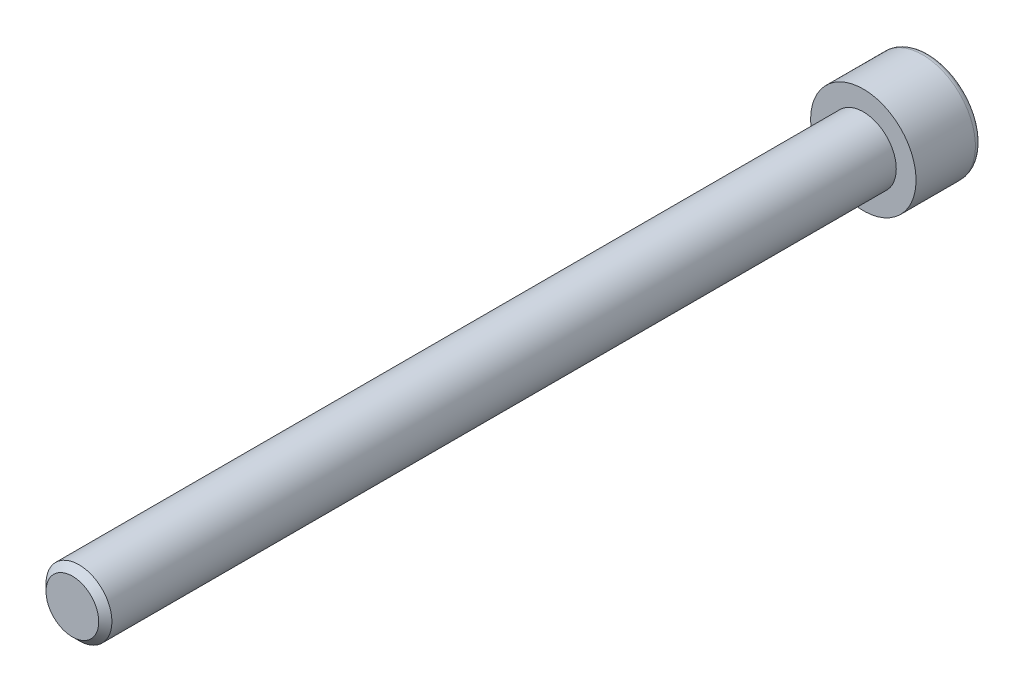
ISO-10303-21;
HEADER;
FILE_DESCRIPTION(('STEP AP214'),'2;1');
FILE_NAME('part.step','',(''),(''),'','','');
FILE_SCHEMA(('AUTOMOTIVE_DESIGN { 1 0 10303 214 1 1 1 1 }'));
ENDSEC;
DATA;
#1=APPLICATION_CONTEXT('core data for automotive mechanical design processes');
#2=APPLICATION_PROTOCOL_DEFINITION('international standard','automotive_design',2000,#1);
#3=PRODUCT_CONTEXT('',#1,'mechanical');
#4=PRODUCT('Part','Part','',(#3));
#5=PRODUCT_RELATED_PRODUCT_CATEGORY('part','',(#4));
#6=PRODUCT_DEFINITION_FORMATION('','',#4);
#7=PRODUCT_DEFINITION_CONTEXT('part definition',#1,'design');
#8=PRODUCT_DEFINITION('design','',#6,#7);
#9=PRODUCT_DEFINITION_SHAPE('','',#8);
#10=(LENGTH_UNIT() NAMED_UNIT(*) SI_UNIT(.MILLI.,.METRE.));
#11=(NAMED_UNIT(*) PLANE_ANGLE_UNIT() SI_UNIT($,.RADIAN.));
#12=(NAMED_UNIT(*) SI_UNIT($,.STERADIAN.) SOLID_ANGLE_UNIT());
#13=UNCERTAINTY_MEASURE_WITH_UNIT(LENGTH_MEASURE(1.E-05),#10,'distance_accuracy_value','');
#14=(GEOMETRIC_REPRESENTATION_CONTEXT(3) GLOBAL_UNCERTAINTY_ASSIGNED_CONTEXT((#13)) GLOBAL_UNIT_ASSIGNED_CONTEXT((#10,
#11,#12)) REPRESENTATION_CONTEXT('',''));
#15=CARTESIAN_POINT('',(0.,0.,0.));
#16=DIRECTION('',(0.,0.,1.));
#17=DIRECTION('',(1.,0.,0.));
#18=AXIS2_PLACEMENT_3D('',#15,#16,#17);
#19=CARTESIAN_POINT('',(0.,0.,0.));
#20=DIRECTION('',(0.,0.,1.));
#21=DIRECTION('',(1.,0.,0.));
#22=AXIS2_PLACEMENT_3D('',#19,#20,#21);
#23=CYLINDRICAL_SURFACE('',#22,5.);
#24=CARTESIAN_POINT('',(0.,0.,0.));
#25=DIRECTION('',(0.,0.,1.));
#26=DIRECTION('',(1.,0.,0.));
#27=AXIS2_PLACEMENT_3D('',#24,#25,#26);
#28=CIRCLE('',#27,5.);
#29=CARTESIAN_POINT('',(5.,0.,0.));
#30=VERTEX_POINT('',#29);
#31=EDGE_CURVE('E226',#30,#30,#28,.T.);
#32=ORIENTED_EDGE('',*,*,#31,.T.);
#33=EDGE_LOOP('',(#32));
#34=FACE_BOUND('',#33,.T.);
#35=CARTESIAN_POINT('',(0.,0.,119.));
#36=DIRECTION('',(0.,0.,1.));
#37=DIRECTION('',(1.,0.,0.));
#38=AXIS2_PLACEMENT_3D('',#35,#36,#37);
#39=CIRCLE('',#38,5.);
#40=CARTESIAN_POINT('',(5.00000000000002,0.,119.));
#41=VERTEX_POINT('',#40);
#42=EDGE_CURVE('E12',#41,#41,#39,.F.);
#43=ORIENTED_EDGE('',*,*,#42,.T.);
#44=EDGE_LOOP('',(#43));
#45=FACE_BOUND('',#44,.T.);
#46=CARTESIAN_POINT('',(-4.83290553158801,-1.28180509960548,71.1037529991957));
#47=CARTESIAN_POINT('',(-4.85551320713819,-1.19654589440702,71.0233285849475));
#48=CARTESIAN_POINT('',(-4.87719702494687,-1.10575607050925,70.9484886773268));
#49=CARTESIAN_POINT('',(-4.91694141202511,-0.912870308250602,70.8139120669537));
#50=CARTESIAN_POINT('',(-4.93500975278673,-0.810799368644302,70.7541428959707));
#51=CARTESIAN_POINT('',(-4.96184102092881,-0.622034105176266,70.6664230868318));
#52=CARTESIAN_POINT('',(-4.97179530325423,-0.537467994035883,70.6342845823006));
#53=CARTESIAN_POINT('',(-4.98749781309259,-0.363909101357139,70.5838433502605));
#54=CARTESIAN_POINT('',(-4.99324959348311,-0.274920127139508,70.5655289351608));
#55=CARTESIAN_POINT('',(-4.99992507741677,-0.0944849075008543,70.5442897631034));
#56=CARTESIAN_POINT('',(-5.00082625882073,-0.00302917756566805,70.5414367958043));
#57=CARTESIAN_POINT('',(-4.99762698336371,0.178906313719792,70.5516007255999));
#58=CARTESIAN_POINT('',(-4.99352557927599,0.269385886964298,70.5646206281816));
#59=CARTESIAN_POINT('',(-4.98121720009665,0.440920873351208,70.6039898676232));
#60=CARTESIAN_POINT('',(-4.97328866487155,0.522209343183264,70.6294364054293));
#61=CARTESIAN_POINT('',(-4.95418277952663,0.680001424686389,70.6913868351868));
#62=CARTESIAN_POINT('',(-4.94300409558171,0.756503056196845,70.7278952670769));
#63=CARTESIAN_POINT('',(-4.91171162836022,0.942348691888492,70.8314826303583));
#64=CARTESIAN_POINT('',(-4.88997563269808,1.04806174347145,70.9045827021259));
#65=CARTESIAN_POINT('',(-4.84329103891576,1.24617454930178,71.0662247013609));
#66=CARTESIAN_POINT('',(-4.81833353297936,1.33853582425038,71.1548096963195));
#67=CARTESIAN_POINT('',(-4.75491063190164,1.55194758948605,71.3886160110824));
#68=CARTESIAN_POINT('',(-4.71572895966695,1.66538972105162,71.540565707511));
#69=CARTESIAN_POINT('',(-4.63963148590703,1.86692267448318,71.8607758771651));
#70=CARTESIAN_POINT('',(-4.60271868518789,1.95498046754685,72.0290572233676));
#71=CARTESIAN_POINT('',(-4.53364209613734,2.11035114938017,72.3840218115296));
#72=CARTESIAN_POINT('',(-4.50172293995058,2.17670919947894,72.5711690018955));
#73=CARTESIAN_POINT('',(-4.44817466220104,2.28415762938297,72.953903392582));
#74=CARTESIAN_POINT('',(-4.42653815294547,2.32526615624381,73.1494844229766));
#75=CARTESIAN_POINT('',(-4.40249291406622,2.37031074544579,73.4638618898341));
#76=CARTESIAN_POINT('',(-4.39583697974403,2.38257930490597,73.5812109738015));
#77=CARTESIAN_POINT('',(-4.38734021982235,2.39819451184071,73.8167097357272));
#78=CARTESIAN_POINT('',(-4.38549988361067,2.40154025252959,73.9348594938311));
#79=CARTESIAN_POINT('',(-4.38673716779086,2.39927812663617,74.1711218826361));
#80=CARTESIAN_POINT('',(-4.38981812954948,2.3936641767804,74.2892344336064));
#81=CARTESIAN_POINT('',(-4.40074724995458,2.37351112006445,74.5244675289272));
#82=CARTESIAN_POINT('',(-4.40859521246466,2.35897238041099,74.6415881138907));
#83=CARTESIAN_POINT('',(-4.42848389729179,2.32141575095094,74.871745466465));
#84=CARTESIAN_POINT('',(-4.44044031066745,2.29856786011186,74.9848173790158));
#85=CARTESIAN_POINT('',(-4.46805516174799,2.24441666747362,75.2085107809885));
#86=CARTESIAN_POINT('',(-4.48371532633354,2.21310942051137,75.3191311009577));
#87=CARTESIAN_POINT('',(-4.51809540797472,2.14204884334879,75.5371264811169));
#88=CARTESIAN_POINT('',(-4.53681491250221,2.102296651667,75.6445019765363));
#89=CARTESIAN_POINT('',(-4.57659337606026,2.01422971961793,75.855235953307));
#90=CARTESIAN_POINT('',(-4.59765256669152,1.96591413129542,75.9585940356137));
#91=CARTESIAN_POINT('',(-4.65207529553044,1.83452683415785,76.2100404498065));
#92=CARTESIAN_POINT('',(-4.68640014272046,1.74604262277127,76.3551522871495));
#93=CARTESIAN_POINT('',(-4.75549317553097,1.54798994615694,76.6300024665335));
#94=CARTESIAN_POINT('',(-4.79026024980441,1.43846720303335,76.7597731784));
#95=CARTESIAN_POINT('',(-4.84563418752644,1.23571015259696,76.9583665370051));
#96=CARTESIAN_POINT('',(-4.86717271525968,1.14873828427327,77.0332954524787));
#97=CARTESIAN_POINT('',(-4.90710454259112,0.963962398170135,77.1694696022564));
#98=CARTESIAN_POINT('',(-4.92550247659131,0.866174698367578,77.230735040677));
#99=CARTESIAN_POINT('',(-4.95404619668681,0.68139344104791,77.324571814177));
#100=CARTESIAN_POINT('',(-4.96510884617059,0.596232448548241,77.3604425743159));
#101=CARTESIAN_POINT('',(-4.98303340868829,0.420854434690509,77.4182087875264));
#102=CARTESIAN_POINT('',(-4.98989929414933,0.330642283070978,77.4401174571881));
#103=CARTESIAN_POINT('',(-4.99868891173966,0.146961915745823,77.468119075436));
#104=CARTESIAN_POINT('',(-5.0005836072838,0.0534777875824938,77.4741191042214));
#105=CARTESIAN_POINT('',(-4.99909999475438,-0.133025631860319,77.4694074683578));
#106=CARTESIAN_POINT('',(-4.99572143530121,-0.226044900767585,77.4586950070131));
#107=CARTESIAN_POINT('',(-4.98462851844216,-0.400591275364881,77.4232682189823));
#108=CARTESIAN_POINT('',(-4.97731555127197,-0.482415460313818,77.3998486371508));
#109=CARTESIAN_POINT('',(-4.95932540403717,-0.641491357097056,77.3416753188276));
#110=CARTESIAN_POINT('',(-4.94864687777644,-0.718741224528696,77.3069170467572));
#111=CARTESIAN_POINT('',(-4.91888005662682,-0.903990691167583,77.2087654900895));
#112=CARTESIAN_POINT('',(-4.89822588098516,-1.00871016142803,77.1396628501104));
#113=CARTESIAN_POINT('',(-4.85356882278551,-1.20544889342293,76.9861161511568));
#114=CARTESIAN_POINT('',(-4.82955697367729,-1.29743279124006,76.9016308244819));
#115=CARTESIAN_POINT('',(-4.76821561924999,-1.51052808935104,76.678009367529));
#116=CARTESIAN_POINT('',(-4.73004372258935,-1.62431984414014,76.5321545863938));
#117=CARTESIAN_POINT('',(-4.65532123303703,-1.8274803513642,76.2241274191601));
#118=CARTESIAN_POINT('',(-4.61877291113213,-1.91681574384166,76.0619331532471));
#119=CARTESIAN_POINT('',(-4.54952646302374,-2.07596493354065,75.7189820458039));
#120=CARTESIAN_POINT('',(-4.51705175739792,-2.14481201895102,75.5377336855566));
#121=CARTESIAN_POINT('',(-4.46136958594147,-2.25836298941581,75.16653618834));
#122=CARTESIAN_POINT('',(-4.43815699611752,-2.30308022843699,74.9765919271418));
#123=CARTESIAN_POINT('',(-4.41059839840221,-2.35522321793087,74.6683179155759));
#124=CARTESIAN_POINT('',(-4.40242042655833,-2.37040772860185,74.5515799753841));
#125=CARTESIAN_POINT('',(-4.39078261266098,-2.39190056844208,74.3170211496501));
#126=CARTESIAN_POINT('',(-4.38732327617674,-2.39820794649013,74.1992001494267));
#127=CARTESIAN_POINT('',(-4.38530415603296,-2.40189704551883,73.9633493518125));
#128=CARTESIAN_POINT('',(-4.38674569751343,-2.39927635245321,73.845319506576));
#129=CARTESIAN_POINT('',(-4.39445671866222,-2.38512372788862,73.6099591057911));
#130=CARTESIAN_POINT('',(-4.40072599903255,-2.37359216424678,73.4926285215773));
#131=CARTESIAN_POINT('',(-4.41763143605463,-2.34197485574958,73.2616188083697));
#132=CARTESIAN_POINT('',(-4.42818669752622,-2.32204733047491,73.147912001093));
#133=CARTESIAN_POINT('',(-4.45318920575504,-2.27372921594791,72.9226979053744));
#134=CARTESIAN_POINT('',(-4.46763815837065,-2.2453349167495,72.8111916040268));
#135=CARTESIAN_POINT('',(-4.49984159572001,-2.18008109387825,72.5910398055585));
#136=CARTESIAN_POINT('',(-4.51759943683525,-2.14321296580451,72.4823973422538));
#137=CARTESIAN_POINT('',(-4.55571262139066,-2.06095262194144,72.2688529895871));
#138=CARTESIAN_POINT('',(-4.57606851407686,-2.01555860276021,72.1639518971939));
#139=CARTESIAN_POINT('',(-4.63426338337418,-1.87949450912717,71.8832973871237));
#140=CARTESIAN_POINT('',(-4.67396659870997,-1.78005066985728,71.7120644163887));
#141=CARTESIAN_POINT('',(-4.75428755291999,-1.55281951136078,71.3899217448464));
#142=CARTESIAN_POINT('',(-4.79490185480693,-1.42512648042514,71.2389470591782));
#143=CARTESIAN_POINT('',(-4.83290553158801,-1.28180509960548,71.1037529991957));
#144=B_SPLINE_CURVE_WITH_KNOTS('',3,(#46,#47,#48,#49,#50,#51,#52,#53,#54,#55,#56,#57,#58,#59,
#60,#61,#62,#63,#64,#65,#66,#67,#68,#69,#70,#71,#72,#73,#74,#75,#76,#77,#78,#79,#80,#81,#82,#83,
#84,#85,#86,#87,#88,#89,#90,#91,#92,#93,#94,#95,#96,#97,#98,#99,#100,#101,#102,#103,#104,#105,
#106,#107,#108,#109,#110,#111,#112,#113,#114,#115,#116,#117,#118,#119,#120,#121,#122,#123,#124,
#125,#126,#127,#128,#129,#130,#131,#132,#133,#134,#135,#136,#137,#138,#139,#140,#141,#142,#143),
.UNSPECIFIED.,.T.,.F.,(4,2,2,2,2,2,2,2,2,2,2,2,2,2,2,2,2,2,2,2,2,2,2,2,2,2,2,2,2,2,2,2,2,2,2,2,
2,2,2,2,2,2,2,2,2,2,2,2,4),(0.,0.357758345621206,0.71473922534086,0.986692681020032,
1.25841595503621,1.53139980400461,1.80443534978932,2.06006244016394,2.3157945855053,
2.70463294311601,3.09457048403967,3.67232098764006,4.25081987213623,4.85212816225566,
5.45300377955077,5.8071481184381,6.16132844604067,6.51574935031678,6.87015567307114,
7.21768527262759,7.56537722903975,7.91302234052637,8.26070189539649,8.77922294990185,
9.29662962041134,9.64599376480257,9.99483782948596,10.272938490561,10.5507755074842,
10.8302317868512,11.1097013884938,11.3649364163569,11.6202736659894,11.9995802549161,
12.379919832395,12.9435130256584,13.5078712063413,14.0957069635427,14.6832170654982,
15.0368505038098,15.3905218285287,15.7442887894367,16.0980411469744,16.4454059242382,
16.7929231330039,17.1407947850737,17.4887401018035,18.0921189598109,18.6935134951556),.UNSPECIFIED.);
#145=CARTESIAN_POINT('',(-4.83290553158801,-1.28180509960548,71.1037529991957));
#146=VERTEX_POINT('',#145);
#147=EDGE_CURVE('E48',#146,#146,#144,.T.);
#148=ORIENTED_EDGE('',*,*,#147,.T.);
#149=EDGE_LOOP('',(#148));
#150=FACE_BOUND('',#149,.T.);
#151=ADVANCED_FACE('F44',(#34,#45,#150),#23,.T.);
#152=CARTESIAN_POINT('',(0.,0.,-10.));
#153=DIRECTION('',(0.,0.,1.));
#154=DIRECTION('',(1.,0.,0.));
#155=AXIS2_PLACEMENT_3D('',#152,#153,#154);
#156=PLANE('',#155);
#157=CARTESIAN_POINT('',(0.,0.,-10.));
#158=DIRECTION('',(0.,0.,-1.));
#159=DIRECTION('',(-1.,0.,0.));
#160=AXIS2_PLACEMENT_3D('',#157,#158,#159);
#161=CIRCLE('',#160,7.);
#162=CARTESIAN_POINT('',(-7.,0.,-10.));
#163=VERTEX_POINT('',#162);
#164=EDGE_CURVE('E172',#163,#163,#161,.T.);
#165=ORIENTED_EDGE('',*,*,#164,.T.);
#166=EDGE_LOOP('',(#165));
#167=FACE_BOUND('',#166,.T.);
#168=DIRECTION('',(-0.86602540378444,0.499999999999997,0.));
#169=VECTOR('',#168,1.);
#170=CARTESIAN_POINT('',(0.,4.61880215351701,-10.));
#171=LINE('',#170,#169);
#172=CARTESIAN_POINT('',(4.,2.30940107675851,-10.));
#173=VERTEX_POINT('',#172);
#174=CARTESIAN_POINT('',(0.,4.61880215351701,-10.));
#175=VERTEX_POINT('',#174);
#176=EDGE_CURVE('E65',#173,#175,#171,.T.);
#177=ORIENTED_EDGE('',*,*,#176,.T.);
#178=DIRECTION('',(-0.866025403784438,-0.500000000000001,0.));
#179=VECTOR('',#178,1.);
#180=CARTESIAN_POINT('',(0.,4.61880215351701,-10.));
#181=LINE('',#180,#179);
#182=CARTESIAN_POINT('',(-4.,2.30940107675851,-10.));
#183=VERTEX_POINT('',#182);
#184=EDGE_CURVE('E222',#175,#183,#181,.T.);
#185=ORIENTED_EDGE('',*,*,#184,.T.);
#186=DIRECTION('',(0.,-1.,0.));
#187=VECTOR('',#186,1.);
#188=CARTESIAN_POINT('',(-4.,-2.30940107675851,-10.));
#189=LINE('',#188,#187);
#190=CARTESIAN_POINT('',(-4.,-2.30940107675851,-10.));
#191=VERTEX_POINT('',#190);
#192=EDGE_CURVE('E219',#183,#191,#189,.T.);
#193=ORIENTED_EDGE('',*,*,#192,.T.);
#194=DIRECTION('',(0.866025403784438,-0.500000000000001,0.));
#195=VECTOR('',#194,1.);
#196=CARTESIAN_POINT('',(0.,-4.61880215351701,-10.));
#197=LINE('',#196,#195);
#198=CARTESIAN_POINT('',(0.,-4.61880215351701,-10.));
#199=VERTEX_POINT('',#198);
#200=EDGE_CURVE('E216',#191,#199,#197,.T.);
#201=ORIENTED_EDGE('',*,*,#200,.T.);
#202=DIRECTION('',(0.86602540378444,0.499999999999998,0.));
#203=VECTOR('',#202,1.);
#204=CARTESIAN_POINT('',(0.,-4.61880215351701,-10.));
#205=LINE('',#204,#203);
#206=CARTESIAN_POINT('',(4.,-2.30940107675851,-10.));
#207=VERTEX_POINT('',#206);
#208=EDGE_CURVE('E213',#199,#207,#205,.T.);
#209=ORIENTED_EDGE('',*,*,#208,.T.);
#210=DIRECTION('',(0.,1.,0.));
#211=VECTOR('',#210,1.);
#212=CARTESIAN_POINT('',(4.,-2.30940107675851,-10.));
#213=LINE('',#212,#211);
#214=EDGE_CURVE('E210',#207,#173,#213,.T.);
#215=ORIENTED_EDGE('',*,*,#214,.T.);
#216=EDGE_LOOP('',(#177,#185,#193,#201,#209,#215));
#217=FACE_BOUND('',#216,.T.);
#218=ADVANCED_FACE('F46',(#167,#217),#156,.F.);
#219=CARTESIAN_POINT('',(0.,0.,-9.));
#220=DIRECTION('',(0.,0.,-1.));
#221=DIRECTION('',(-1.,0.,0.));
#222=AXIS2_PLACEMENT_3D('',#219,#220,#221);
#223=TOROIDAL_SURFACE('',#222,7.,0.999999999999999);
#224=ORIENTED_EDGE('',*,*,#164,.F.);
#225=EDGE_LOOP('',(#224));
#226=FACE_BOUND('',#225,.T.);
#227=CARTESIAN_POINT('',(0.,0.,-9.));
#228=DIRECTION('',(0.,0.,-1.));
#229=DIRECTION('',(-1.,0.,0.));
#230=AXIS2_PLACEMENT_3D('',#227,#228,#229);
#231=CIRCLE('',#230,8.);
#232=CARTESIAN_POINT('',(-8.,0.,-9.));
#233=VERTEX_POINT('',#232);
#234=EDGE_CURVE('E175',#233,#233,#231,.T.);
#235=ORIENTED_EDGE('',*,*,#234,.T.);
#236=EDGE_LOOP('',(#235));
#237=FACE_BOUND('',#236,.T.);
#238=ADVANCED_FACE('F123',(#226,#237),#223,.T.);
#239=CARTESIAN_POINT('',(0.,0.,0.));
#240=DIRECTION('',(0.,0.,-1.));
#241=DIRECTION('',(-1.,0.,0.));
#242=AXIS2_PLACEMENT_3D('',#239,#240,#241);
#243=CYLINDRICAL_SURFACE('',#242,8.);
#244=ORIENTED_EDGE('',*,*,#234,.F.);
#245=EDGE_LOOP('',(#244));
#246=FACE_BOUND('',#245,.T.);
#247=CARTESIAN_POINT('',(0.,0.,0.));
#248=DIRECTION('',(0.,0.,-1.));
#249=DIRECTION('',(-1.,0.,0.));
#250=AXIS2_PLACEMENT_3D('',#247,#248,#249);
#251=CIRCLE('',#250,8.);
#252=CARTESIAN_POINT('',(-8.,0.,0.));
#253=VERTEX_POINT('',#252);
#254=EDGE_CURVE('E176',#253,#253,#251,.T.);
#255=ORIENTED_EDGE('',*,*,#254,.T.);
#256=EDGE_LOOP('',(#255));
#257=FACE_BOUND('',#256,.T.);
#258=ADVANCED_FACE('F161',(#246,#257),#243,.T.);
#259=CARTESIAN_POINT('',(0.,0.,0.));
#260=DIRECTION('',(0.,0.,-1.));
#261=DIRECTION('',(-1.,0.,0.));
#262=AXIS2_PLACEMENT_3D('',#259,#260,#261);
#263=PLANE('',#262);
#264=ORIENTED_EDGE('',*,*,#31,.F.);
#265=EDGE_LOOP('',(#264));
#266=FACE_BOUND('',#265,.T.);
#267=ORIENTED_EDGE('',*,*,#254,.F.);
#268=EDGE_LOOP('',(#267));
#269=FACE_BOUND('',#268,.T.);
#270=ADVANCED_FACE('F158',(#266,#269),#263,.F.);
#271=CARTESIAN_POINT('',(0.,4.61880215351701,-5.));
#272=DIRECTION('',(-0.499999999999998,-0.86602540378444,0.));
#273=DIRECTION('',(0.86602540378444,-0.499999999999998,0.));
#274=AXIS2_PLACEMENT_3D('',#271,#272,#273);
#275=PLANE('',#274);
#276=ORIENTED_EDGE('',*,*,#176,.F.);
#277=DIRECTION('',(0.,0.,-1.));
#278=VECTOR('',#277,1.);
#279=CARTESIAN_POINT('',(4.,2.30940107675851,-5.));
#280=LINE('',#279,#278);
#281=CARTESIAN_POINT('',(4.,2.30940107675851,-5.));
#282=VERTEX_POINT('',#281);
#283=EDGE_CURVE('E196',#282,#173,#280,.T.);
#284=ORIENTED_EDGE('',*,*,#283,.F.);
#285=DIRECTION('',(-0.86602540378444,0.499999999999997,0.));
#286=VECTOR('',#285,1.);
#287=CARTESIAN_POINT('',(0.,4.61880215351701,-5.));
#288=LINE('',#287,#286);
#289=CARTESIAN_POINT('',(0.,4.61880215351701,-5.));
#290=VERTEX_POINT('',#289);
#291=EDGE_CURVE('E207',#282,#290,#288,.T.);
#292=ORIENTED_EDGE('',*,*,#291,.T.);
#293=DIRECTION('',(0.,0.,-1.));
#294=VECTOR('',#293,1.);
#295=CARTESIAN_POINT('',(0.,4.61880215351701,-5.));
#296=LINE('',#295,#294);
#297=EDGE_CURVE('E179',#290,#175,#296,.T.);
#298=ORIENTED_EDGE('',*,*,#297,.T.);
#299=EDGE_LOOP('',(#276,#284,#292,#298));
#300=FACE_BOUND('',#299,.T.);
#301=ADVANCED_FACE('F154',(#300),#275,.T.);
#302=CARTESIAN_POINT('',(0.,4.61880215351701,-5.));
#303=DIRECTION('',(0.500000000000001,-0.866025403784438,0.));
#304=DIRECTION('',(0.866025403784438,0.500000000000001,0.));
#305=AXIS2_PLACEMENT_3D('',#302,#303,#304);
#306=PLANE('',#305);
#307=ORIENTED_EDGE('',*,*,#184,.F.);
#308=ORIENTED_EDGE('',*,*,#297,.F.);
#309=DIRECTION('',(-0.866025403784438,-0.500000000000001,0.));
#310=VECTOR('',#309,1.);
#311=CARTESIAN_POINT('',(0.,4.61880215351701,-5.));
#312=LINE('',#311,#310);
#313=CARTESIAN_POINT('',(-4.,2.30940107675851,-5.));
#314=VERTEX_POINT('',#313);
#315=EDGE_CURVE('E205',#290,#314,#312,.T.);
#316=ORIENTED_EDGE('',*,*,#315,.T.);
#317=DIRECTION('',(0.,0.,-1.));
#318=VECTOR('',#317,1.);
#319=CARTESIAN_POINT('',(-4.,2.30940107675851,-5.));
#320=LINE('',#319,#318);
#321=EDGE_CURVE('E188',#314,#183,#320,.T.);
#322=ORIENTED_EDGE('',*,*,#321,.T.);
#323=EDGE_LOOP('',(#307,#308,#316,#322));
#324=FACE_BOUND('',#323,.T.);
#325=ADVANCED_FACE('F150',(#324),#306,.T.);
#326=CARTESIAN_POINT('',(-4.,-2.30940107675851,-5.));
#327=DIRECTION('',(1.,0.,0.));
#328=DIRECTION('',(0.,0.,-1.));
#329=AXIS2_PLACEMENT_3D('',#326,#327,#328);
#330=PLANE('',#329);
#331=ORIENTED_EDGE('',*,*,#192,.F.);
#332=ORIENTED_EDGE('',*,*,#321,.F.);
#333=DIRECTION('',(0.,-1.,0.));
#334=VECTOR('',#333,1.);
#335=CARTESIAN_POINT('',(-4.,-2.30940107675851,-5.));
#336=LINE('',#335,#334);
#337=CARTESIAN_POINT('',(-4.,-2.30940107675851,-5.));
#338=VERTEX_POINT('',#337);
#339=EDGE_CURVE('E203',#314,#338,#336,.T.);
#340=ORIENTED_EDGE('',*,*,#339,.T.);
#341=DIRECTION('',(0.,0.,-1.));
#342=VECTOR('',#341,1.);
#343=CARTESIAN_POINT('',(-4.,-2.30940107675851,-5.));
#344=LINE('',#343,#342);
#345=EDGE_CURVE('E190',#338,#191,#344,.T.);
#346=ORIENTED_EDGE('',*,*,#345,.T.);
#347=EDGE_LOOP('',(#331,#332,#340,#346));
#348=FACE_BOUND('',#347,.T.);
#349=ADVANCED_FACE('F146',(#348),#330,.T.);
#350=CARTESIAN_POINT('',(0.,-4.61880215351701,-5.));
#351=DIRECTION('',(0.500000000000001,0.866025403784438,0.));
#352=DIRECTION('',(-0.866025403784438,0.500000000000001,0.));
#353=AXIS2_PLACEMENT_3D('',#350,#351,#352);
#354=PLANE('',#353);
#355=ORIENTED_EDGE('',*,*,#200,.F.);
#356=ORIENTED_EDGE('',*,*,#345,.F.);
#357=DIRECTION('',(0.866025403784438,-0.500000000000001,0.));
#358=VECTOR('',#357,1.);
#359=CARTESIAN_POINT('',(0.,-4.61880215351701,-5.));
#360=LINE('',#359,#358);
#361=CARTESIAN_POINT('',(0.,-4.61880215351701,-5.));
#362=VERTEX_POINT('',#361);
#363=EDGE_CURVE('E201',#338,#362,#360,.T.);
#364=ORIENTED_EDGE('',*,*,#363,.T.);
#365=DIRECTION('',(0.,0.,-1.));
#366=VECTOR('',#365,1.);
#367=CARTESIAN_POINT('',(0.,-4.61880215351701,-5.));
#368=LINE('',#367,#366);
#369=EDGE_CURVE('E192',#362,#199,#368,.T.);
#370=ORIENTED_EDGE('',*,*,#369,.T.);
#371=EDGE_LOOP('',(#355,#356,#364,#370));
#372=FACE_BOUND('',#371,.T.);
#373=ADVANCED_FACE('F142',(#372),#354,.T.);
#374=CARTESIAN_POINT('',(0.,-4.61880215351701,-5.));
#375=DIRECTION('',(-0.499999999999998,0.86602540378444,0.));
#376=DIRECTION('',(-0.86602540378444,-0.499999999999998,0.));
#377=AXIS2_PLACEMENT_3D('',#374,#375,#376);
#378=PLANE('',#377);
#379=ORIENTED_EDGE('',*,*,#208,.F.);
#380=ORIENTED_EDGE('',*,*,#369,.F.);
#381=DIRECTION('',(0.86602540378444,0.499999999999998,0.));
#382=VECTOR('',#381,1.);
#383=CARTESIAN_POINT('',(0.,-4.61880215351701,-5.));
#384=LINE('',#383,#382);
#385=CARTESIAN_POINT('',(4.,-2.30940107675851,-5.));
#386=VERTEX_POINT('',#385);
#387=EDGE_CURVE('E199',#362,#386,#384,.T.);
#388=ORIENTED_EDGE('',*,*,#387,.T.);
#389=DIRECTION('',(0.,0.,-1.));
#390=VECTOR('',#389,1.);
#391=CARTESIAN_POINT('',(4.,-2.30940107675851,-5.));
#392=LINE('',#391,#390);
#393=EDGE_CURVE('E194',#386,#207,#392,.T.);
#394=ORIENTED_EDGE('',*,*,#393,.T.);
#395=EDGE_LOOP('',(#379,#380,#388,#394));
#396=FACE_BOUND('',#395,.T.);
#397=ADVANCED_FACE('F139',(#396),#378,.T.);
#398=CARTESIAN_POINT('',(4.,-2.30940107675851,-5.));
#399=DIRECTION('',(-1.,0.,0.));
#400=DIRECTION('',(0.,-1.,0.));
#401=AXIS2_PLACEMENT_3D('',#398,#399,#400);
#402=PLANE('',#401);
#403=ORIENTED_EDGE('',*,*,#214,.F.);
#404=ORIENTED_EDGE('',*,*,#393,.F.);
#405=DIRECTION('',(0.,1.,0.));
#406=VECTOR('',#405,1.);
#407=CARTESIAN_POINT('',(4.,-2.30940107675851,-5.));
#408=LINE('',#407,#406);
#409=EDGE_CURVE('E72',#386,#282,#408,.T.);
#410=ORIENTED_EDGE('',*,*,#409,.T.);
#411=ORIENTED_EDGE('',*,*,#283,.T.);
#412=EDGE_LOOP('',(#403,#404,#410,#411));
#413=FACE_BOUND('',#412,.T.);
#414=ADVANCED_FACE('F135',(#413),#402,.T.);
#415=CARTESIAN_POINT('',(4.,2.30940107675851,-5.));
#416=DIRECTION('',(0.,0.,1.));
#417=DIRECTION('',(1.,0.,0.));
#418=AXIS2_PLACEMENT_3D('',#415,#416,#417);
#419=PLANE('',#418);
#420=ORIENTED_EDGE('',*,*,#291,.F.);
#421=ORIENTED_EDGE('',*,*,#409,.F.);
#422=ORIENTED_EDGE('',*,*,#387,.F.);
#423=ORIENTED_EDGE('',*,*,#363,.F.);
#424=ORIENTED_EDGE('',*,*,#339,.F.);
#425=ORIENTED_EDGE('',*,*,#315,.F.);
#426=EDGE_LOOP('',(#420,#421,#422,#423,#424,#425));
#427=FACE_BOUND('',#426,.T.);
#428=ADVANCED_FACE('F131',(#427),#419,.F.);
#429=CARTESIAN_POINT('',(0.,0.,120.));
#430=DIRECTION('',(0.,0.,1.));
#431=DIRECTION('',(1.,0.,0.));
#432=AXIS2_PLACEMENT_3D('',#429,#430,#431);
#433=PLANE('',#432);
#434=CARTESIAN_POINT('',(0.,0.,120.));
#435=DIRECTION('',(0.,0.,1.));
#436=DIRECTION('',(1.,0.,0.));
#437=AXIS2_PLACEMENT_3D('',#434,#435,#436);
#438=CIRCLE('',#437,4.00000000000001);
#439=CARTESIAN_POINT('',(4.00000000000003,0.,120.));
#440=VERTEX_POINT('',#439);
#441=EDGE_CURVE('E58',#440,#440,#438,.T.);
#442=ORIENTED_EDGE('',*,*,#441,.T.);
#443=EDGE_LOOP('',(#442));
#444=FACE_BOUND('',#443,.T.);
#445=ADVANCED_FACE('F113',(#444),#433,.T.);
#446=CARTESIAN_POINT('',(0.,0.,120.));
#447=DIRECTION('',(0.,0.,-1.));
#448=DIRECTION('',(-1.,0.,0.));
#449=AXIS2_PLACEMENT_3D('',#446,#447,#448);
#450=CONICAL_SURFACE('',#449,4.00000000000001,0.785398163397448);
#451=ORIENTED_EDGE('',*,*,#42,.F.);
#452=EDGE_LOOP('',(#451));
#453=FACE_BOUND('',#452,.T.);
#454=ORIENTED_EDGE('',*,*,#441,.F.);
#455=EDGE_LOOP('',(#454));
#456=FACE_BOUND('',#455,.T.);
#457=ADVANCED_FACE('F108',(#453,#456),#450,.T.);
#458=CARTESIAN_POINT('',(-5.70774902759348,0.,74.0081640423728));
#459=DIRECTION('',(-1.,0.,0.));
#460=DIRECTION('',(0.,-1.,0.));
#461=AXIS2_PLACEMENT_3D('',#458,#459,#460);
#462=CONICAL_SURFACE('',#461,4.68995888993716,1.0471975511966);
#463=ORIENTED_EDGE('',*,*,#147,.F.);
#464=EDGE_LOOP('',(#463));
#465=FACE_BOUND('',#464,.T.);
#466=CARTESIAN_POINT('',(-3.,0.,74.0081640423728));
#467=VERTEX_POINT('',#466);
#468=VERTEX_LOOP('',#467);
#469=FACE_BOUND('',#468,.T.);
#470=ADVANCED_FACE('F106',(#465,#469),#462,.F.);
#471=CLOSED_SHELL('',(#151,#218,#238,#258,#270,#301,#325,#349,#373,#397,#414,#428,#445,#457,#470));
#472=MANIFOLD_SOLID_BREP('B2',#471);
#473=ADVANCED_BREP_SHAPE_REPRESENTATION('',(#18,#472),#14);
#474=SHAPE_DEFINITION_REPRESENTATION(#9,#473);
ENDSEC;
END-ISO-10303-21;
